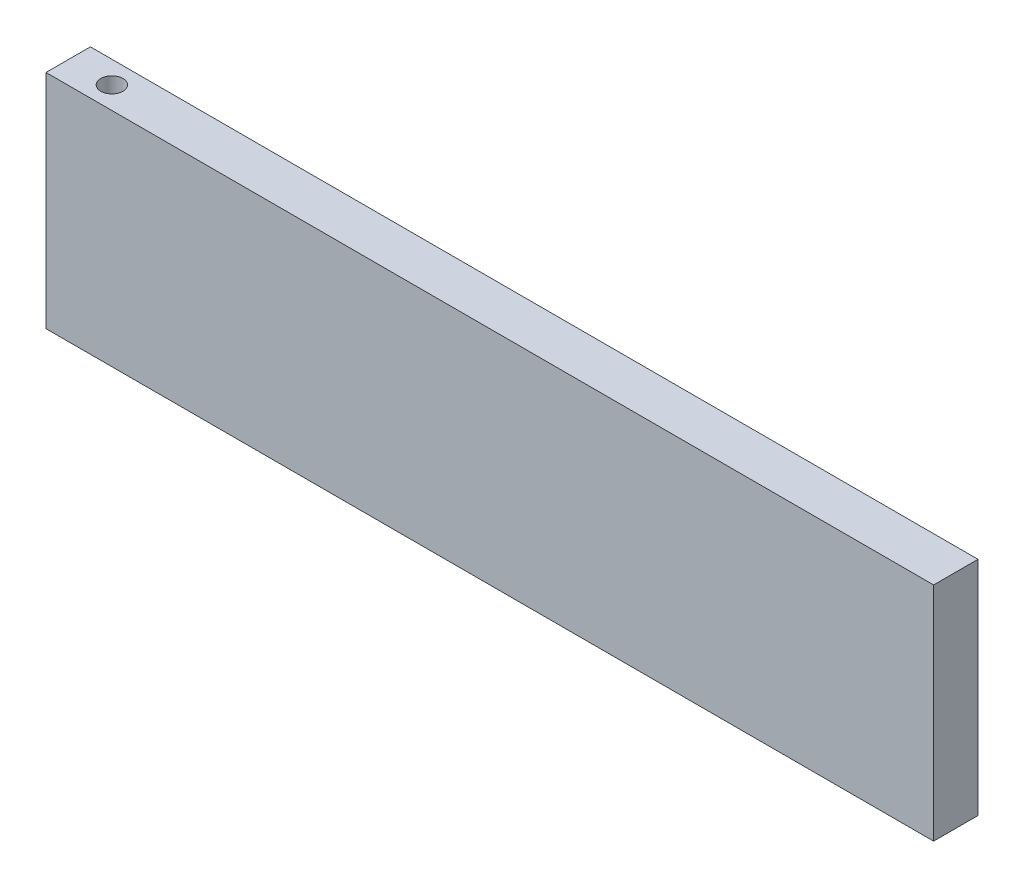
ISO-10303-21;
HEADER;
FILE_DESCRIPTION(('STEP AP214'),'2;1');
FILE_NAME('part.step','',(''),(''),'','','');
FILE_SCHEMA(('AUTOMOTIVE_DESIGN { 1 0 10303 214 1 1 1 1 }'));
ENDSEC;
DATA;
#1=APPLICATION_CONTEXT('core data for automotive mechanical design processes');
#2=APPLICATION_PROTOCOL_DEFINITION('international standard','automotive_design',2000,#1);
#3=PRODUCT_CONTEXT('',#1,'mechanical');
#4=PRODUCT('Part','Part','',(#3));
#5=PRODUCT_RELATED_PRODUCT_CATEGORY('part','',(#4));
#6=PRODUCT_DEFINITION_FORMATION('','',#4);
#7=PRODUCT_DEFINITION_CONTEXT('part definition',#1,'design');
#8=PRODUCT_DEFINITION('design','',#6,#7);
#9=PRODUCT_DEFINITION_SHAPE('','',#8);
#10=(LENGTH_UNIT() NAMED_UNIT(*) SI_UNIT(.MILLI.,.METRE.));
#11=(NAMED_UNIT(*) PLANE_ANGLE_UNIT() SI_UNIT($,.RADIAN.));
#12=(NAMED_UNIT(*) SI_UNIT($,.STERADIAN.) SOLID_ANGLE_UNIT());
#13=UNCERTAINTY_MEASURE_WITH_UNIT(LENGTH_MEASURE(1.E-05),#10,'distance_accuracy_value','');
#14=(GEOMETRIC_REPRESENTATION_CONTEXT(3) GLOBAL_UNCERTAINTY_ASSIGNED_CONTEXT((#13)) GLOBAL_UNIT_ASSIGNED_CONTEXT((#10,
#11,#12)) REPRESENTATION_CONTEXT('',''));
#15=CARTESIAN_POINT('',(0.,0.,0.));
#16=DIRECTION('',(0.,0.,1.));
#17=DIRECTION('',(1.,0.,0.));
#18=AXIS2_PLACEMENT_3D('',#15,#16,#17);
#19=CARTESIAN_POINT('',(0.,-63.5,683.310502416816));
#20=DIRECTION('',(-1.,0.,0.));
#21=DIRECTION('',(0.,0.,1.));
#22=AXIS2_PLACEMENT_3D('',#19,#20,#21);
#23=PLANE('',#22);
#24=DIRECTION('',(0.,0.,-1.));
#25=VECTOR('',#24,1.);
#26=CARTESIAN_POINT('',(0.,-63.5,683.310502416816));
#27=LINE('',#26,#25);
#28=CARTESIAN_POINT('',(0.,-63.5,12.7));
#29=VERTEX_POINT('',#28);
#30=CARTESIAN_POINT('',(0.,-63.5,0.));
#31=VERTEX_POINT('',#30);
#32=EDGE_CURVE('E82',#29,#31,#27,.T.);
#33=ORIENTED_EDGE('',*,*,#32,.F.);
#34=DIRECTION('',(0.,1.,0.));
#35=VECTOR('',#34,1.);
#36=CARTESIAN_POINT('',(0.,63.5,12.7));
#37=LINE('',#36,#35);
#38=CARTESIAN_POINT('',(0.,0.,12.7));
#39=VERTEX_POINT('',#38);
#40=EDGE_CURVE('E78',#29,#39,#37,.T.);
#41=ORIENTED_EDGE('',*,*,#40,.T.);
#42=DIRECTION('',(0.,0.,-1.));
#43=VECTOR('',#42,1.);
#44=CARTESIAN_POINT('',(0.,0.,683.310502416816));
#45=LINE('',#44,#43);
#46=CARTESIAN_POINT('',(0.,0.,0.));
#47=VERTEX_POINT('',#46);
#48=EDGE_CURVE('E80',#39,#47,#45,.T.);
#49=ORIENTED_EDGE('',*,*,#48,.T.);
#50=DIRECTION('',(0.,1.,0.));
#51=VECTOR('',#50,1.);
#52=CARTESIAN_POINT('',(0.,63.5,0.));
#53=LINE('',#52,#51);
#54=EDGE_CURVE('E11',#31,#47,#53,.T.);
#55=ORIENTED_EDGE('',*,*,#54,.F.);
#56=EDGE_LOOP('',(#33,#41,#49,#55));
#57=FACE_BOUND('',#56,.T.);
#58=ADVANCED_FACE('F36',(#57),#23,.T.);
#59=CARTESIAN_POINT('',(0.,0.,683.310502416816));
#60=DIRECTION('',(0.,1.,0.));
#61=DIRECTION('',(0.,0.,1.));
#62=AXIS2_PLACEMENT_3D('',#59,#60,#61);
#63=PLANE('',#62);
#64=CARTESIAN_POINT('',(12.5,0.,6.34999999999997));
#65=DIRECTION('',(0.,1.,0.));
#66=DIRECTION('',(0.,0.,1.));
#67=AXIS2_PLACEMENT_3D('',#64,#65,#66);
#68=CIRCLE('',#67,3.17499999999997);
#69=CARTESIAN_POINT('',(12.5,0.,9.52499999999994));
#70=VERTEX_POINT('',#69);
#71=EDGE_CURVE('E44',#70,#70,#68,.F.);
#72=ORIENTED_EDGE('',*,*,#71,.T.);
#73=EDGE_LOOP('',(#72));
#74=FACE_BOUND('',#73,.T.);
#75=ORIENTED_EDGE('',*,*,#48,.F.);
#76=DIRECTION('',(1.,0.,0.));
#77=VECTOR('',#76,1.);
#78=CARTESIAN_POINT('',(-254.,0.,12.7));
#79=LINE('',#78,#77);
#80=CARTESIAN_POINT('',(254.,0.,12.7));
#81=VERTEX_POINT('',#80);
#82=EDGE_CURVE('E85',#39,#81,#79,.T.);
#83=ORIENTED_EDGE('',*,*,#82,.T.);
#84=DIRECTION('',(0.,0.,-1.));
#85=VECTOR('',#84,1.);
#86=CARTESIAN_POINT('',(254.,0.,683.310502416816));
#87=LINE('',#86,#85);
#88=CARTESIAN_POINT('',(254.,0.,0.));
#89=VERTEX_POINT('',#88);
#90=EDGE_CURVE('E51',#81,#89,#87,.T.);
#91=ORIENTED_EDGE('',*,*,#90,.T.);
#92=DIRECTION('',(1.,0.,0.));
#93=VECTOR('',#92,1.);
#94=CARTESIAN_POINT('',(-254.,0.,0.));
#95=LINE('',#94,#93);
#96=EDGE_CURVE('E88',#47,#89,#95,.T.);
#97=ORIENTED_EDGE('',*,*,#96,.F.);
#98=EDGE_LOOP('',(#75,#83,#91,#97));
#99=FACE_BOUND('',#98,.T.);
#100=ADVANCED_FACE('F87',(#74,#99),#63,.T.);
#101=CARTESIAN_POINT('',(-254.,-63.5,12.7));
#102=DIRECTION('',(0.,1.,0.));
#103=DIRECTION('',(0.,0.,1.));
#104=AXIS2_PLACEMENT_3D('',#101,#102,#103);
#105=PLANE('',#104);
#106=CARTESIAN_POINT('',(12.5,-63.5,6.34999999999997));
#107=DIRECTION('',(0.,-1.,0.));
#108=DIRECTION('',(0.,0.,-1.));
#109=AXIS2_PLACEMENT_3D('',#106,#107,#108);
#110=CIRCLE('',#109,3.17499999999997);
#111=CARTESIAN_POINT('',(12.5,-63.5,3.175));
#112=VERTEX_POINT('',#111);
#113=EDGE_CURVE('E84',#112,#112,#110,.T.);
#114=ORIENTED_EDGE('',*,*,#113,.F.);
#115=EDGE_LOOP('',(#114));
#116=FACE_BOUND('',#115,.T.);
#117=ORIENTED_EDGE('',*,*,#32,.T.);
#118=DIRECTION('',(1.,0.,0.));
#119=VECTOR('',#118,1.);
#120=CARTESIAN_POINT('',(-254.,-63.5,0.));
#121=LINE('',#120,#119);
#122=CARTESIAN_POINT('',(254.,-63.5,0.));
#123=VERTEX_POINT('',#122);
#124=EDGE_CURVE('E99',#31,#123,#121,.T.);
#125=ORIENTED_EDGE('',*,*,#124,.T.);
#126=DIRECTION('',(0.,0.,-1.));
#127=VECTOR('',#126,1.);
#128=CARTESIAN_POINT('',(254.,-63.5,12.7));
#129=LINE('',#128,#127);
#130=CARTESIAN_POINT('',(254.,-63.5,12.7));
#131=VERTEX_POINT('',#130);
#132=EDGE_CURVE('E103',#131,#123,#129,.T.);
#133=ORIENTED_EDGE('',*,*,#132,.F.);
#134=DIRECTION('',(1.,0.,0.));
#135=VECTOR('',#134,1.);
#136=CARTESIAN_POINT('',(-254.,-63.5,12.7));
#137=LINE('',#136,#135);
#138=EDGE_CURVE('E60',#29,#131,#137,.T.);
#139=ORIENTED_EDGE('',*,*,#138,.F.);
#140=EDGE_LOOP('',(#117,#125,#133,#139));
#141=FACE_BOUND('',#140,.T.);
#142=ADVANCED_FACE('F38',(#116,#141),#105,.F.);
#143=CARTESIAN_POINT('',(254.,-63.5,12.7));
#144=DIRECTION('',(-1.,0.,0.));
#145=DIRECTION('',(0.,-1.,0.));
#146=AXIS2_PLACEMENT_3D('',#143,#144,#145);
#147=PLANE('',#146);
#148=ORIENTED_EDGE('',*,*,#90,.F.);
#149=DIRECTION('',(0.,1.,0.));
#150=VECTOR('',#149,1.);
#151=CARTESIAN_POINT('',(254.,-63.5,12.7));
#152=LINE('',#151,#150);
#153=EDGE_CURVE('E92',#131,#81,#152,.T.);
#154=ORIENTED_EDGE('',*,*,#153,.F.);
#155=ORIENTED_EDGE('',*,*,#132,.T.);
#156=DIRECTION('',(0.,1.,0.));
#157=VECTOR('',#156,1.);
#158=CARTESIAN_POINT('',(254.,-63.5,0.));
#159=LINE('',#158,#157);
#160=EDGE_CURVE('E101',#123,#89,#159,.T.);
#161=ORIENTED_EDGE('',*,*,#160,.T.);
#162=EDGE_LOOP('',(#148,#154,#155,#161));
#163=FACE_BOUND('',#162,.T.);
#164=ADVANCED_FACE('F132',(#163),#147,.F.);
#165=CARTESIAN_POINT('',(-254.,63.5,12.7));
#166=DIRECTION('',(0.,0.,-1.));
#167=DIRECTION('',(-1.,0.,0.));
#168=AXIS2_PLACEMENT_3D('',#165,#166,#167);
#169=PLANE('',#168);
#170=ORIENTED_EDGE('',*,*,#40,.F.);
#171=ORIENTED_EDGE('',*,*,#138,.T.);
#172=ORIENTED_EDGE('',*,*,#153,.T.);
#173=ORIENTED_EDGE('',*,*,#82,.F.);
#174=EDGE_LOOP('',(#170,#171,#172,#173));
#175=FACE_BOUND('',#174,.T.);
#176=ADVANCED_FACE('F90',(#175),#169,.F.);
#177=CARTESIAN_POINT('',(-254.,63.5,0.));
#178=DIRECTION('',(0.,0.,-1.));
#179=DIRECTION('',(-1.,0.,0.));
#180=AXIS2_PLACEMENT_3D('',#177,#178,#179);
#181=PLANE('',#180);
#182=ORIENTED_EDGE('',*,*,#124,.F.);
#183=ORIENTED_EDGE('',*,*,#54,.T.);
#184=ORIENTED_EDGE('',*,*,#96,.T.);
#185=ORIENTED_EDGE('',*,*,#160,.F.);
#186=EDGE_LOOP('',(#182,#183,#184,#185));
#187=FACE_BOUND('',#186,.T.);
#188=ADVANCED_FACE('F114',(#187),#181,.T.);
#189=CARTESIAN_POINT('',(12.5,63.5,6.34999999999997));
#190=DIRECTION('',(0.,-1.,0.));
#191=DIRECTION('',(0.,0.,-1.));
#192=AXIS2_PLACEMENT_3D('',#189,#190,#191);
#193=CYLINDRICAL_SURFACE('',#192,3.17499999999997);
#194=ORIENTED_EDGE('',*,*,#113,.T.);
#195=EDGE_LOOP('',(#194));
#196=FACE_BOUND('',#195,.T.);
#197=ORIENTED_EDGE('',*,*,#71,.F.);
#198=EDGE_LOOP('',(#197));
#199=FACE_BOUND('',#198,.T.);
#200=ADVANCED_FACE('F112',(#196,#199),#193,.F.);
#201=CLOSED_SHELL('',(#58,#100,#142,#164,#176,#188,#200));
#202=MANIFOLD_SOLID_BREP('B2',#201);
#203=ADVANCED_BREP_SHAPE_REPRESENTATION('',(#18,#202),#14);
#204=SHAPE_DEFINITION_REPRESENTATION(#9,#203);
ENDSEC;
END-ISO-10303-21;
